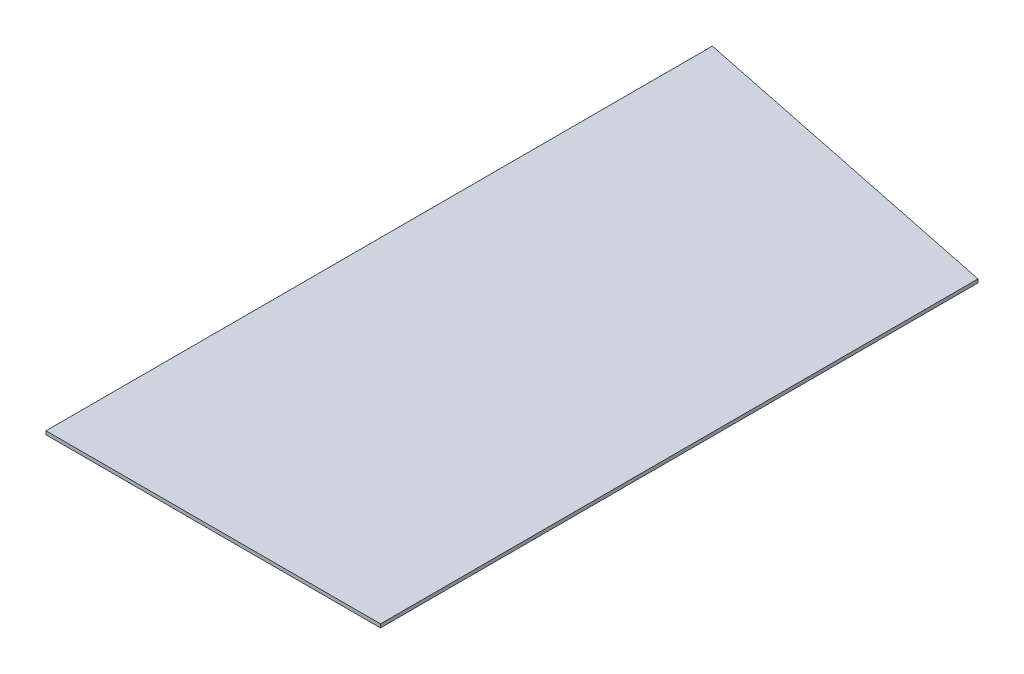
from build123d import *

# Parameters (mm, degrees)
BOSS_EXTRUDE1_DEPTH = 6.35


with BuildPart() as part:
    # Sketch1 → Boss-Extrude1 (new body)
    with BuildSketch(Plane(origin=(0, 0, 0), x_dir=(1, 0, 0), z_dir=(0, 1, 0))):
        Polygon((-304.8, 638.571875), (304.8, 513.159375), (304.8, -575.865625), (-304.8, -575.865625), align=None)
    extrude(amount=BOSS_EXTRUDE1_DEPTH)


solid = part.part
